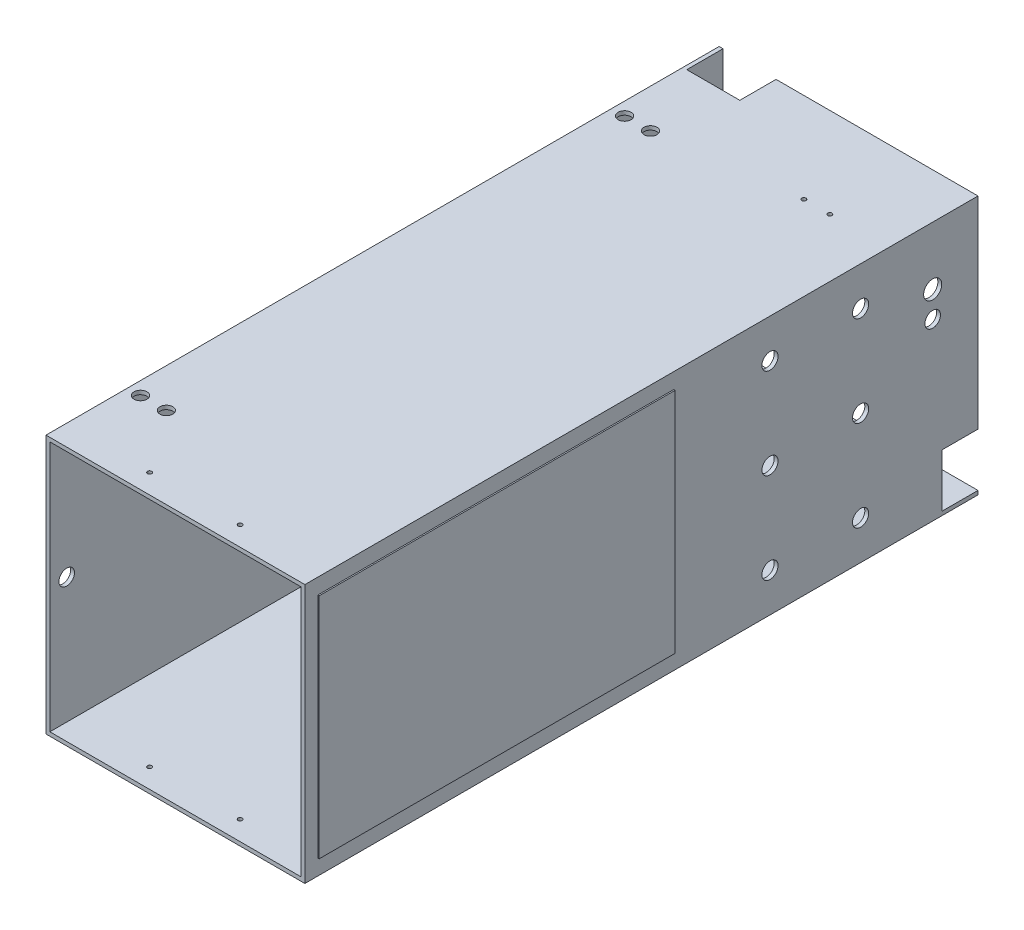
from build123d import *

# Parameters (mm, degrees)
ESQUISSE1_W                     = 200
ESQUISSE1_H                     = 200
ESQUISSE1_W_2                   = 194
ESQUISSE1_H_2                   = 194
EXTRUSION1_DEPTH                = 520
ENL_V_MAT_EXTRU_1_REACH         = 593.946
ESQUISSE2_R                     = 7
ESQUISSE2_R_2                   = 6
ESQUISSE2_R_3                   = 6.25
ESQUISSE2_W                     = 28
ESQUISSE2_H                     = 41
ESQUISSE2_W_2                   = 265
ESQUISSE2_H_2                   = 160
TROU_TARAUD_M41_REACH           = 570.761
TROU_TARAUD_M41_BORE_R          = 1.65
R_P_TITION_LIN_AIRE1_COUNT      = 2
R_P_TITION_LIN_AIRE1_PITCH      = 125
R_P_TITION_LIN_AIRE2_COUNT      = 2
R_P_TITION_LIN_AIRE2_PITCH      = 255
ENL_V_MAT_EXTRU_2_REACH         = 593.946
ESQUISSE5_R                     = 0.5
ESQUISSE5_R_2                   = 6
ESQUISSE5_R_3                   = 7
ENL_V_MAT_EXTRU_3_REACH         = 593.946
ESQUISSE6_R                     = 0.5
ESQUISSE6_R_2                   = 5
ESQUISSE6_W                     = 41
ESQUISSE6_H                     = 28
ENL_V_MAT_EXTRU_4_REACH         = 593.946
ESQUISSE7_R                     = 6
ESQUISSE7_R_2                   = 2.5
ESQUISSE8_W                     = 275
ESQUISSE8_H                     = 176
EXTRUSION2_DEPTH                = 1
TROU_TARAUD_M42_D               = 3.3
TROU_TARAUD_M42_DEPTH           = 200
TROU_TARAUD_M42_ON_FACE_2_D     = 3.3
TROU_TARAUD_M42_ON_FACE_2_DEPTH = 200


with BuildPart() as part:
    # Esquisse1 → Extrusion1 (new body)
    with BuildSketch(Plane.XY):
        with Locations((100, 100)):
            Rectangle(ESQUISSE1_W, ESQUISSE1_H)
        with Locations((100, 100)):
            Rectangle(ESQUISSE1_W_2, ESQUISSE1_H_2, mode=Mode.SUBTRACT)
    extrude(amount=EXTRUSION1_DEPTH)

    # Esquisse2 → Enl_v. mat.-Extru.1 (cut, up to next)
    with BuildSketch(Plane(origin=(200, 0, 0), x_dir=(0, 0, -1), z_dir=(1, 0, 0)), mode=Mode.PRIVATE) as enl_v_mat_extru_1_sk1:
        with Locations((-35, 155)):
            Circle(ESQUISSE2_R)
    enl_v_mat_extru_1_tool1 = extrude(enl_v_mat_extru_1_sk1.sketch, amount=-ENL_V_MAT_EXTRU_1_REACH, mode=Mode.PRIVATE) & part.part
    # Esquisse2 → Enl_v. mat.-Extru.1 (cut, up to next)
    with BuildSketch(Plane(origin=(200, 0, 0), x_dir=(0, 0, -1), z_dir=(1, 0, 0)), mode=Mode.PRIVATE) as enl_v_mat_extru_1_sk2:
        with Locations((-35, 135)):
            Circle(ESQUISSE2_R_2)
    enl_v_mat_extru_1_tool2 = extrude(enl_v_mat_extru_1_sk2.sketch, amount=-ENL_V_MAT_EXTRU_1_REACH, mode=Mode.PRIVATE) & part.part
    # Esquisse2 → Enl_v. mat.-Extru.1 (cut, up to next)
    with BuildSketch(Plane(origin=(200, 0, 0), x_dir=(0, 0, -1), z_dir=(1, 0, 0)), mode=Mode.PRIVATE) as enl_v_mat_extru_1_sk3:
        with Locations((-90.7, 170)):
            Circle(ESQUISSE2_R_3)
    enl_v_mat_extru_1_tool3 = extrude(enl_v_mat_extru_1_sk3.sketch, amount=-ENL_V_MAT_EXTRU_1_REACH, mode=Mode.PRIVATE) & part.part
    # Esquisse2 → Enl_v. mat.-Extru.1 (cut, up to next)
    with BuildSketch(Plane(origin=(200, 0, 0), x_dir=(0, 0, -1), z_dir=(1, 0, 0)), mode=Mode.PRIVATE) as enl_v_mat_extru_1_sk4:
        with Locations((-160.7, 170)):
            Circle(ESQUISSE2_R_3)
    enl_v_mat_extru_1_tool4 = extrude(enl_v_mat_extru_1_sk4.sketch, amount=-ENL_V_MAT_EXTRU_1_REACH, mode=Mode.PRIVATE) & part.part
    # Esquisse2 → Enl_v. mat.-Extru.1 (cut, up to next)
    with BuildSketch(Plane(origin=(200, 0, 0), x_dir=(0, 0, -1), z_dir=(1, 0, 0)), mode=Mode.PRIVATE) as enl_v_mat_extru_1_sk5:
        with Locations((-90.7, 100)):
            Circle(ESQUISSE2_R_3)
    enl_v_mat_extru_1_tool5 = extrude(enl_v_mat_extru_1_sk5.sketch, amount=-ENL_V_MAT_EXTRU_1_REACH, mode=Mode.PRIVATE) & part.part
    # Esquisse2 → Enl_v. mat.-Extru.1 (cut, up to next)
    with BuildSketch(Plane(origin=(200, 0, 0), x_dir=(0, 0, -1), z_dir=(1, 0, 0)), mode=Mode.PRIVATE) as enl_v_mat_extru_1_sk6:
        with Locations((-160.7, 100)):
            Circle(ESQUISSE2_R_3)
    enl_v_mat_extru_1_tool6 = extrude(enl_v_mat_extru_1_sk6.sketch, amount=-ENL_V_MAT_EXTRU_1_REACH, mode=Mode.PRIVATE) & part.part
    # Esquisse2 → Enl_v. mat.-Extru.1 (cut, up to next)
    with BuildSketch(Plane(origin=(200, 0, 0), x_dir=(0, 0, -1), z_dir=(1, 0, 0)), mode=Mode.PRIVATE) as enl_v_mat_extru_1_sk7:
        with Locations((-90.7, 30)):
            Circle(ESQUISSE2_R_3)
    enl_v_mat_extru_1_tool7 = extrude(enl_v_mat_extru_1_sk7.sketch, amount=-ENL_V_MAT_EXTRU_1_REACH, mode=Mode.PRIVATE) & part.part
    # Esquisse2 → Enl_v. mat.-Extru.1 (cut, up to next)
    with BuildSketch(Plane(origin=(200, 0, 0), x_dir=(0, 0, -1), z_dir=(1, 0, 0)), mode=Mode.PRIVATE) as enl_v_mat_extru_1_sk8:
        with Locations((-160.7, 30)):
            Circle(ESQUISSE2_R_3)
    enl_v_mat_extru_1_tool8 = extrude(enl_v_mat_extru_1_sk8.sketch, amount=-ENL_V_MAT_EXTRU_1_REACH, mode=Mode.PRIVATE) & part.part
    # Esquisse2 → Enl_v. mat.-Extru.1 (cut, up to next)
    with BuildSketch(Plane(origin=(200, 0, 0), x_dir=(0, 0, -1), z_dir=(1, 0, 0)), mode=Mode.PRIVATE) as enl_v_mat_extru_1_sk9:
        with Locations((-14, 23.5)):
            Rectangle(ESQUISSE2_W, ESQUISSE2_H)
    enl_v_mat_extru_1_tool9 = extrude(enl_v_mat_extru_1_sk9.sketch, amount=-ENL_V_MAT_EXTRU_1_REACH, mode=Mode.PRIVATE) & part.part
    # Esquisse2 → Enl_v. mat.-Extru.1 (cut, up to next)
    with BuildSketch(Plane(origin=(200, 0, 0), x_dir=(0, 0, -1), z_dir=(1, 0, 0)), mode=Mode.PRIVATE) as enl_v_mat_extru_1_sk10:
        with Locations((-372.5, 100)):
            Rectangle(ESQUISSE2_W_2, ESQUISSE2_H_2)
    enl_v_mat_extru_1_tool10 = extrude(enl_v_mat_extru_1_sk10.sketch, amount=-ENL_V_MAT_EXTRU_1_REACH, mode=Mode.PRIVATE) & part.part
    add(enl_v_mat_extru_1_tool1.solids().sort_by_distance((200, 155, 35))[0], mode=Mode.SUBTRACT)
    add(enl_v_mat_extru_1_tool2.solids().sort_by_distance((200, 135, 35))[0], mode=Mode.SUBTRACT)
    add(enl_v_mat_extru_1_tool3.solids().sort_by_distance((200, 170, 90.7))[0], mode=Mode.SUBTRACT)
    add(enl_v_mat_extru_1_tool4.solids().sort_by_distance((200, 170, 160.7))[0], mode=Mode.SUBTRACT)
    add(enl_v_mat_extru_1_tool5.solids().sort_by_distance((200, 100, 90.7))[0], mode=Mode.SUBTRACT)
    add(enl_v_mat_extru_1_tool6.solids().sort_by_distance((200, 100, 160.7))[0], mode=Mode.SUBTRACT)
    add(enl_v_mat_extru_1_tool7.solids().sort_by_distance((200, 30, 90.7))[0], mode=Mode.SUBTRACT)
    add(enl_v_mat_extru_1_tool8.solids().sort_by_distance((200, 30, 160.7))[0], mode=Mode.SUBTRACT)
    add(enl_v_mat_extru_1_tool9.solids().sort_by_distance((200, 23.5, 14))[0], mode=Mode.SUBTRACT)
    add(enl_v_mat_extru_1_tool10.solids().sort_by_distance((200, 100, 372.5))[0], mode=Mode.SUBTRACT)

    # Trou taraud_ M41 bore (on position points) → Trou taraud_ M41 (cut, up to next)
    with BuildSketch(Plane(origin=(200, 17, 500), x_dir=(0, 0, 1), z_dir=(1, 0, 0)), mode=Mode.PRIVATE) as trou_taraud_m41_sk1:
        Circle(TROU_TARAUD_M41_BORE_R)
    trou_taraud_m41_tool1 = extrude(trou_taraud_m41_sk1.sketch, amount=-TROU_TARAUD_M41_REACH, mode=Mode.PRIVATE) & part.part
    # Trou taraud_ M41 bore (on position points) → Trou taraud_ M41 (cut, up to next)
    with BuildSketch(Plane(origin=(200, 17, 500), x_dir=(0, 0, 1), z_dir=(1, 0, 0)), mode=Mode.PRIVATE) as trou_taraud_m41_sk2:
        with Locations((0, -166)):
            Circle(TROU_TARAUD_M41_BORE_R)
    trou_taraud_m41_tool2 = extrude(trou_taraud_m41_sk2.sketch, amount=-TROU_TARAUD_M41_REACH, mode=Mode.PRIVATE) & part.part
    trou_taraud_m41_1 = trou_taraud_m41_tool1.solids().sort_by_distance((200, 17, 500))[0]
    add(trou_taraud_m41_1, mode=Mode.SUBTRACT)
    trou_taraud_m41_2 = trou_taraud_m41_tool2.solids().sort_by_distance((200, 183, 500))[0]
    add(trou_taraud_m41_2, mode=Mode.SUBTRACT)
    trou_taraud_m41 = trou_taraud_m41_1 + trou_taraud_m41_2  # Trou taraud_ M41 as one shape, for the pattern or mirror that repeats it

    # R_p_tition lin_aire1: Trou taraud_ M41 ×2
    with Locations(*[(0, 0, -i * R_P_TITION_LIN_AIRE1_PITCH) for i in range(1, R_P_TITION_LIN_AIRE1_COUNT)]):
        add(trou_taraud_m41, mode=Mode.SUBTRACT)

    # R_p_tition lin_aire2: Trou taraud_ M41 ×2
    with Locations(*[(0, 0, -i * R_P_TITION_LIN_AIRE2_PITCH) for i in range(1, R_P_TITION_LIN_AIRE2_COUNT)]):
        add(trou_taraud_m41, mode=Mode.SUBTRACT)

    # Esquisse5 → Enl_v. mat.-Extru.2 (cut, up to next)
    with BuildSketch(Plane.XZ, mode=Mode.PRIVATE) as enl_v_mat_extru_2_sk1:
        with Locations(Location((65, 505, 0), (0, 0, 270))):
            Circle(ESQUISSE5_R)
    enl_v_mat_extru_2_tool1 = extrude(enl_v_mat_extru_2_sk1.sketch, amount=-ENL_V_MAT_EXTRU_2_REACH, mode=Mode.PRIVATE) & part.part
    # Esquisse5 → Enl_v. mat.-Extru.2 (cut, up to next)
    with BuildSketch(Plane.XZ, mode=Mode.PRIVATE) as enl_v_mat_extru_2_sk2:
        with Locations(Location((135, 505, 0), (0, 0, 270))):
            Circle(ESQUISSE5_R)
    enl_v_mat_extru_2_tool2 = extrude(enl_v_mat_extru_2_sk2.sketch, amount=-ENL_V_MAT_EXTRU_2_REACH, mode=Mode.PRIVATE) & part.part
    # Esquisse5 → Enl_v. mat.-Extru.2 (cut, up to next)
    with BuildSketch(Plane.XZ, mode=Mode.PRIVATE) as enl_v_mat_extru_2_sk3:
        with Locations(Location((150, 380, 0), (0, 0, 270))):
            Circle(ESQUISSE5_R_2)
    enl_v_mat_extru_2_tool3 = extrude(enl_v_mat_extru_2_sk3.sketch, amount=-ENL_V_MAT_EXTRU_2_REACH, mode=Mode.PRIVATE) & part.part
    # Esquisse5 → Enl_v. mat.-Extru.2 (cut, up to next)
    with BuildSketch(Plane.XZ, mode=Mode.PRIVATE) as enl_v_mat_extru_2_sk4:
        with Locations(Location((170, 206.7, 0), (0, 0, 270))):
            Circle(ESQUISSE5_R_3)
    enl_v_mat_extru_2_tool4 = extrude(enl_v_mat_extru_2_sk4.sketch, amount=-ENL_V_MAT_EXTRU_2_REACH, mode=Mode.PRIVATE) & part.part
    add(enl_v_mat_extru_2_tool1.solids().sort_by_distance((65, 0, 505))[0], mode=Mode.SUBTRACT)
    add(enl_v_mat_extru_2_tool2.solids().sort_by_distance((135, 0, 505))[0], mode=Mode.SUBTRACT)
    add(enl_v_mat_extru_2_tool3.solids().sort_by_distance((150, 0, 380))[0], mode=Mode.SUBTRACT)
    add(enl_v_mat_extru_2_tool4.solids().sort_by_distance((170, 0, 206.7))[0], mode=Mode.SUBTRACT)

    # Esquisse6 → Enl_v. mat.-Extru.3 (cut, up to next)
    with BuildSketch(Plane(origin=(0, 200, 0), x_dir=(1, 0, 0), z_dir=(0, 1, 0)), mode=Mode.PRIVATE) as enl_v_mat_extru_3_sk1:
        with Locations(Location((135, -505, 0), (0, 0, 90))):
            Circle(ESQUISSE6_R)
    enl_v_mat_extru_3_tool1 = extrude(enl_v_mat_extru_3_sk1.sketch, amount=-ENL_V_MAT_EXTRU_3_REACH, mode=Mode.PRIVATE) & part.part
    # Esquisse6 → Enl_v. mat.-Extru.3 (cut, up to next)
    with BuildSketch(Plane(origin=(0, 200, 0), x_dir=(1, 0, 0), z_dir=(0, 1, 0)), mode=Mode.PRIVATE) as enl_v_mat_extru_3_sk2:
        with Locations(Location((65, -505, 0), (0, 0, 90))):
            Circle(ESQUISSE6_R)
    enl_v_mat_extru_3_tool2 = extrude(enl_v_mat_extru_3_sk2.sketch, amount=-ENL_V_MAT_EXTRU_3_REACH, mode=Mode.PRIVATE) & part.part
    # Esquisse6 → Enl_v. mat.-Extru.3 (cut, up to next)
    with BuildSketch(Plane(origin=(0, 200, 0), x_dir=(1, 0, 0), z_dir=(0, 1, 0)), mode=Mode.PRIVATE) as enl_v_mat_extru_3_sk3:
        with Locations(Location((10, -83, 0), (0, 0, 270))):
            Circle(ESQUISSE6_R_2)
    enl_v_mat_extru_3_tool3 = extrude(enl_v_mat_extru_3_sk3.sketch, amount=-ENL_V_MAT_EXTRU_3_REACH, mode=Mode.PRIVATE) & part.part
    # Esquisse6 → Enl_v. mat.-Extru.3 (cut, up to next)
    with BuildSketch(Plane(origin=(0, 200, 0), x_dir=(1, 0, 0), z_dir=(0, 1, 0)), mode=Mode.PRIVATE) as enl_v_mat_extru_3_sk4:
        with Locations(Location((30, -83, 0), (0, 0, 270))):
            Circle(ESQUISSE6_R_2)
    enl_v_mat_extru_3_tool4 = extrude(enl_v_mat_extru_3_sk4.sketch, amount=-ENL_V_MAT_EXTRU_3_REACH, mode=Mode.PRIVATE) & part.part
    # Esquisse6 → Enl_v. mat.-Extru.3 (cut, up to next)
    with BuildSketch(Plane(origin=(0, 200, 0), x_dir=(1, 0, 0), z_dir=(0, 1, 0)), mode=Mode.PRIVATE) as enl_v_mat_extru_3_sk5:
        with Locations(Location((10, -457, 0), (0, 0, 270))):
            Circle(ESQUISSE6_R_2)
    enl_v_mat_extru_3_tool5 = extrude(enl_v_mat_extru_3_sk5.sketch, amount=-ENL_V_MAT_EXTRU_3_REACH, mode=Mode.PRIVATE) & part.part
    # Esquisse6 → Enl_v. mat.-Extru.3 (cut, up to next)
    with BuildSketch(Plane(origin=(0, 200, 0), x_dir=(1, 0, 0), z_dir=(0, 1, 0)), mode=Mode.PRIVATE) as enl_v_mat_extru_3_sk6:
        with Locations(Location((30, -457, 0), (0, 0, 270))):
            Circle(ESQUISSE6_R_2)
    enl_v_mat_extru_3_tool6 = extrude(enl_v_mat_extru_3_sk6.sketch, amount=-ENL_V_MAT_EXTRU_3_REACH, mode=Mode.PRIVATE) & part.part
    # Esquisse6 → Enl_v. mat.-Extru.3 (cut, up to next)
    with BuildSketch(Plane(origin=(0, 200, 0), x_dir=(1, 0, 0), z_dir=(0, 1, 0)), mode=Mode.PRIVATE) as enl_v_mat_extru_3_sk7:
        with Locations(Location((155, -69.5, 0), (0, 0, 270))):
            Circle(ESQUISSE6_R)
    enl_v_mat_extru_3_tool7 = extrude(enl_v_mat_extru_3_sk7.sketch, amount=-ENL_V_MAT_EXTRU_3_REACH, mode=Mode.PRIVATE) & part.part
    # Esquisse6 → Enl_v. mat.-Extru.3 (cut, up to next)
    with BuildSketch(Plane(origin=(0, 200, 0), x_dir=(1, 0, 0), z_dir=(0, 1, 0)), mode=Mode.PRIVATE) as enl_v_mat_extru_3_sk8:
        with Locations(Location((135, -69.5, 0), (0, 0, 270))):
            Circle(ESQUISSE6_R)
    enl_v_mat_extru_3_tool8 = extrude(enl_v_mat_extru_3_sk8.sketch, amount=-ENL_V_MAT_EXTRU_3_REACH, mode=Mode.PRIVATE) & part.part
    # Esquisse6 → Enl_v. mat.-Extru.3 (cut, up to next)
    with BuildSketch(Plane(origin=(0, 200, 0), x_dir=(1, 0, 0), z_dir=(0, 1, 0)), mode=Mode.PRIVATE) as enl_v_mat_extru_3_sk9:
        with Locations((23.5, -14)):
            Rectangle(ESQUISSE6_W, ESQUISSE6_H)
    enl_v_mat_extru_3_tool9 = extrude(enl_v_mat_extru_3_sk9.sketch, amount=-ENL_V_MAT_EXTRU_3_REACH, mode=Mode.PRIVATE) & part.part
    add(enl_v_mat_extru_3_tool1.solids().sort_by_distance((135, 200, 505))[0], mode=Mode.SUBTRACT)
    add(enl_v_mat_extru_3_tool2.solids().sort_by_distance((65, 200, 505))[0], mode=Mode.SUBTRACT)
    add(enl_v_mat_extru_3_tool3.solids().sort_by_distance((10, 200, 83))[0], mode=Mode.SUBTRACT)
    add(enl_v_mat_extru_3_tool4.solids().sort_by_distance((30, 200, 83))[0], mode=Mode.SUBTRACT)
    add(enl_v_mat_extru_3_tool5.solids().sort_by_distance((10, 200, 457))[0], mode=Mode.SUBTRACT)
    add(enl_v_mat_extru_3_tool6.solids().sort_by_distance((30, 200, 457))[0], mode=Mode.SUBTRACT)
    add(enl_v_mat_extru_3_tool7.solids().sort_by_distance((155, 200, 69.5))[0], mode=Mode.SUBTRACT)
    add(enl_v_mat_extru_3_tool8.solids().sort_by_distance((135, 200, 69.5))[0], mode=Mode.SUBTRACT)
    add(enl_v_mat_extru_3_tool9.solids().sort_by_distance((23.5, 200, 14))[0], mode=Mode.SUBTRACT)

    # Esquisse7 → Enl_v. mat.-Extru.4 (cut, up to next)
    with BuildSketch(Plane.ZY, mode=Mode.PRIVATE) as enl_v_mat_extru_4_sk1:
        with Locations((507, 100)):
            Circle(ESQUISSE7_R)
    enl_v_mat_extru_4_tool1 = extrude(enl_v_mat_extru_4_sk1.sketch, amount=-ENL_V_MAT_EXTRU_4_REACH, mode=Mode.PRIVATE) & part.part
    # Esquisse7 → Enl_v. mat.-Extru.4 (cut, up to next)
    with BuildSketch(Plane.ZY, mode=Mode.PRIVATE) as enl_v_mat_extru_4_sk2:
        with Locations((35, 135)):
            Circle(ESQUISSE7_R_2)
    enl_v_mat_extru_4_tool2 = extrude(enl_v_mat_extru_4_sk2.sketch, amount=-ENL_V_MAT_EXTRU_4_REACH, mode=Mode.PRIVATE) & part.part
    add(enl_v_mat_extru_4_tool1.solids().sort_by_distance((0, 100, 507))[0], mode=Mode.SUBTRACT)
    add(enl_v_mat_extru_4_tool2.solids().sort_by_distance((0, 135, 35))[0], mode=Mode.SUBTRACT)

    # Esquisse8 → Extrusion2 (add)
    with BuildSketch(Plane(origin=(200, 0, 0), x_dir=(0, 0, -1), z_dir=(1, 0, 0))):
        with Locations((-372.5, 100)):
            Rectangle(ESQUISSE8_W, ESQUISSE8_H)
    extrude(amount=EXTRUSION2_DEPTH)

    # Trou taraud_ M42
    with Locations(Plane(origin=(155, 200, 69.5), x_dir=(0, 0, 1), z_dir=(0, 1, 0))):
        with Locations((0, 0), (0, -20), (435.5, -20), (435.5, -90)):
            Hole(TROU_TARAUD_M42_D / 2, depth=TROU_TARAUD_M42_DEPTH)

    # Trou taraud_ M42 on face 2
    with Locations(Plane(origin=(65, 3, 505), x_dir=(0, 0, 1), z_dir=(0, 1, 0))):
        with Locations((0, 0), (0, 70)):
            Hole(TROU_TARAUD_M42_ON_FACE_2_D / 2, depth=TROU_TARAUD_M42_ON_FACE_2_DEPTH)


solid = part.part
